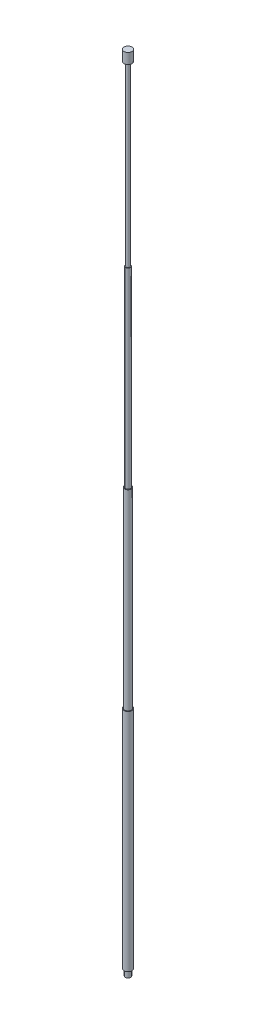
from build123d import *

# Parameters (mm, degrees)
ESQUISSE1_R      = 2.125
EXTRUSION1_DEPTH = 120
ESQUISSE2_R      = 1.725
EXTRUSION2_DEPTH = 102
ESQUISSE3_R      = 1.325
EXTRUSION3_DEPTH = 102
ESQUISSE4_R      = 0.925
EXTRUSION4_DEPTH = 100
EXTRUSION5_START = -5.6
ESQUISSE5_R      = 2.125
EXTRUSION5_DEPTH = 5.6
ESQUISSE6_R      = 1.435
EXTRUSION6_DEPTH = 3.4


with BuildPart() as part:
    # Esquisse1 → Extrusion1 (new body)
    with BuildSketch(Plane(origin=(0, 0, 0), x_dir=(1, 0, 0), z_dir=(0, 1, 0))):
        with Locations(Location((0, 0, 0), (0, 0, 270))):
            Circle(ESQUISSE1_R)
    extrude(amount=EXTRUSION1_DEPTH)

    # Esquisse2 → Extrusion2 (add)
    with BuildSketch(Plane(origin=(0, 120, 0), x_dir=(-1, 0, 0), z_dir=(0, 1, 0))):
        with Locations(Location((0, 0, 0), (0, 0, 90))):
            Circle(ESQUISSE2_R)
    extrude(amount=EXTRUSION2_DEPTH)

    # Esquisse3 → Extrusion3 (add)
    with BuildSketch(Plane(origin=(0, 222, 0), x_dir=(-1, 0, 0), z_dir=(0, 1, 0))):
        with Locations(Location((0, 0, 0), (0, 0, 90))):
            Circle(ESQUISSE3_R)
    extrude(amount=EXTRUSION3_DEPTH)

    # Esquisse4 → Extrusion4 (add)
    with BuildSketch(Plane(origin=(0, 324, 0), x_dir=(-1, 0, 0), z_dir=(0, 1, 0))):
        with Locations(Location((0, 0, 0), (0, 0, 90))):
            Circle(ESQUISSE4_R)
    extrude(amount=EXTRUSION4_DEPTH)

    # Esquisse5 → Extrusion5 (add)
    with BuildSketch(Plane(origin=(0, 424, 0), x_dir=(-1, 0, 0), z_dir=(0, 1, 0)).offset(EXTRUSION5_START)):
        with Locations(Location((0, 0, 0), (0, 0, 90))):
            Circle(ESQUISSE5_R)
    extrude(amount=EXTRUSION5_DEPTH)

    # Esquisse6 → Extrusion6 (add)
    with BuildSketch(Plane.XZ):
        with Locations(Location((0, 0, 0), (0, 0, 90))):
            Circle(ESQUISSE6_R)
    extrude(amount=EXTRUSION6_DEPTH)


solid = part.part
